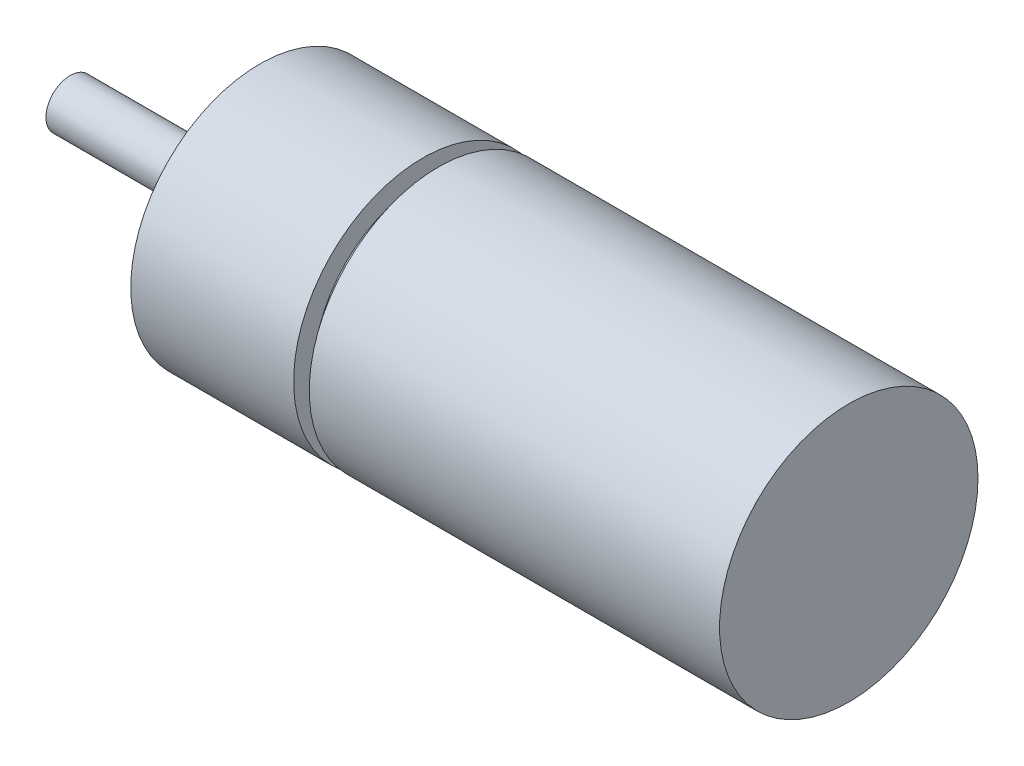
ISO-10303-21;
HEADER;
FILE_DESCRIPTION(('STEP AP214'),'2;1');
FILE_NAME('part.step','',(''),(''),'','','');
FILE_SCHEMA(('AUTOMOTIVE_DESIGN { 1 0 10303 214 1 1 1 1 }'));
ENDSEC;
DATA;
#1=APPLICATION_CONTEXT('core data for automotive mechanical design processes');
#2=APPLICATION_PROTOCOL_DEFINITION('international standard','automotive_design',2000,#1);
#3=PRODUCT_CONTEXT('',#1,'mechanical');
#4=PRODUCT('Part','Part','',(#3));
#5=PRODUCT_RELATED_PRODUCT_CATEGORY('part','',(#4));
#6=PRODUCT_DEFINITION_FORMATION('','',#4);
#7=PRODUCT_DEFINITION_CONTEXT('part definition',#1,'design');
#8=PRODUCT_DEFINITION('design','',#6,#7);
#9=PRODUCT_DEFINITION_SHAPE('','',#8);
#10=(LENGTH_UNIT() NAMED_UNIT(*) SI_UNIT(.MILLI.,.METRE.));
#11=(NAMED_UNIT(*) PLANE_ANGLE_UNIT() SI_UNIT($,.RADIAN.));
#12=(NAMED_UNIT(*) SI_UNIT($,.STERADIAN.) SOLID_ANGLE_UNIT());
#13=UNCERTAINTY_MEASURE_WITH_UNIT(LENGTH_MEASURE(1.E-05),#10,'distance_accuracy_value','');
#14=(GEOMETRIC_REPRESENTATION_CONTEXT(3) GLOBAL_UNCERTAINTY_ASSIGNED_CONTEXT((#13)) GLOBAL_UNIT_ASSIGNED_CONTEXT((#10,
#11,#12)) REPRESENTATION_CONTEXT('',''));
#15=CARTESIAN_POINT('',(0.,0.,0.));
#16=DIRECTION('',(0.,0.,1.));
#17=DIRECTION('',(1.,0.,0.));
#18=AXIS2_PLACEMENT_3D('',#15,#16,#17);
#19=CARTESIAN_POINT('',(-48.2,1.49999999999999,0.));
#20=DIRECTION('',(-1.,0.,0.));
#21=DIRECTION('',(0.,0.,1.));
#22=AXIS2_PLACEMENT_3D('',#19,#20,#21);
#23=PLANE('',#22);
#24=CARTESIAN_POINT('',(-48.2,0.,0.));
#25=DIRECTION('',(1.,0.,0.));
#26=DIRECTION('',(0.,0.,-1.));
#27=AXIS2_PLACEMENT_3D('',#24,#25,#26);
#28=CIRCLE('',#27,1.49999999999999);
#29=CARTESIAN_POINT('',(-48.2,0.,-1.49999999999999));
#30=VERTEX_POINT('',#29);
#31=EDGE_CURVE('E11',#30,#30,#28,.T.);
#32=ORIENTED_EDGE('',*,*,#31,.F.);
#33=EDGE_LOOP('',(#32));
#34=FACE_BOUND('',#33,.T.);
#35=ADVANCED_FACE('F31',(#34),#23,.T.);
#36=CARTESIAN_POINT('',(0.,0.,0.));
#37=DIRECTION('',(1.,0.,0.));
#38=DIRECTION('',(0.,0.,-1.));
#39=AXIS2_PLACEMENT_3D('',#36,#37,#38);
#40=CYLINDRICAL_SURFACE('',#39,1.49999999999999);
#41=ORIENTED_EDGE('',*,*,#31,.T.);
#42=EDGE_LOOP('',(#41));
#43=FACE_BOUND('',#42,.T.);
#44=CARTESIAN_POINT('',(-38.45,0.,0.));
#45=DIRECTION('',(1.,0.,0.));
#46=DIRECTION('',(0.,0.,-1.));
#47=AXIS2_PLACEMENT_3D('',#44,#45,#46);
#48=CIRCLE('',#47,1.5);
#49=CARTESIAN_POINT('',(-38.45,0.,-1.5));
#50=VERTEX_POINT('',#49);
#51=EDGE_CURVE('E38',#50,#50,#48,.T.);
#52=ORIENTED_EDGE('',*,*,#51,.F.);
#53=EDGE_LOOP('',(#52));
#54=FACE_BOUND('',#53,.T.);
#55=ADVANCED_FACE('F93',(#43,#54),#40,.T.);
#56=CARTESIAN_POINT('',(-38.45,3.,0.));
#57=DIRECTION('',(-1.,0.,0.));
#58=DIRECTION('',(0.,0.,1.));
#59=AXIS2_PLACEMENT_3D('',#56,#57,#58);
#60=PLANE('',#59);
#61=ORIENTED_EDGE('',*,*,#51,.T.);
#62=EDGE_LOOP('',(#61));
#63=FACE_BOUND('',#62,.T.);
#64=CARTESIAN_POINT('',(-38.45,0.,0.));
#65=DIRECTION('',(1.,0.,0.));
#66=DIRECTION('',(0.,0.,-1.));
#67=AXIS2_PLACEMENT_3D('',#64,#65,#66);
#68=CIRCLE('',#67,3.);
#69=CARTESIAN_POINT('',(-38.45,0.,-3.));
#70=VERTEX_POINT('',#69);
#71=EDGE_CURVE('E85',#70,#70,#68,.T.);
#72=ORIENTED_EDGE('',*,*,#71,.F.);
#73=EDGE_LOOP('',(#72));
#74=FACE_BOUND('',#73,.T.);
#75=ADVANCED_FACE('F90',(#63,#74),#60,.T.);
#76=CARTESIAN_POINT('',(0.,0.,0.));
#77=DIRECTION('',(1.,0.,0.));
#78=DIRECTION('',(0.,0.,-1.));
#79=AXIS2_PLACEMENT_3D('',#76,#77,#78);
#80=CYLINDRICAL_SURFACE('',#79,3.);
#81=ORIENTED_EDGE('',*,*,#71,.T.);
#82=EDGE_LOOP('',(#81));
#83=FACE_BOUND('',#82,.T.);
#84=CARTESIAN_POINT('',(-36.45,0.,0.));
#85=DIRECTION('',(1.,0.,0.));
#86=DIRECTION('',(0.,0.,-1.));
#87=AXIS2_PLACEMENT_3D('',#84,#85,#86);
#88=CIRCLE('',#87,3.);
#89=CARTESIAN_POINT('',(-36.45,0.,-3.));
#90=VERTEX_POINT('',#89);
#91=EDGE_CURVE('E82',#90,#90,#88,.T.);
#92=ORIENTED_EDGE('',*,*,#91,.F.);
#93=EDGE_LOOP('',(#92));
#94=FACE_BOUND('',#93,.T.);
#95=ADVANCED_FACE('F100',(#83,#94),#80,.T.);
#96=CARTESIAN_POINT('',(-36.45,7.99999999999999,0.));
#97=DIRECTION('',(-1.,0.,0.));
#98=DIRECTION('',(0.,0.,1.));
#99=AXIS2_PLACEMENT_3D('',#96,#97,#98);
#100=PLANE('',#99);
#101=CARTESIAN_POINT('',(-36.45,5.,0.));
#102=DIRECTION('',(-1.,0.,0.));
#103=DIRECTION('',(0.,0.,1.));
#104=AXIS2_PLACEMENT_3D('',#101,#102,#103);
#105=CIRCLE('',#104,0.799999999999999);
#106=CARTESIAN_POINT('',(-36.45,5.,0.799999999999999));
#107=VERTEX_POINT('',#106);
#108=EDGE_CURVE('E53',#107,#107,#105,.T.);
#109=ORIENTED_EDGE('',*,*,#108,.F.);
#110=EDGE_LOOP('',(#109));
#111=FACE_BOUND('',#110,.T.);
#112=CARTESIAN_POINT('',(-36.45,-5.,0.));
#113=DIRECTION('',(-1.,0.,0.));
#114=DIRECTION('',(0.,0.,1.));
#115=AXIS2_PLACEMENT_3D('',#112,#113,#114);
#116=CIRCLE('',#115,0.799999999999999);
#117=CARTESIAN_POINT('',(-36.45,-5.,0.8));
#118=VERTEX_POINT('',#117);
#119=EDGE_CURVE('E61',#118,#118,#116,.T.);
#120=ORIENTED_EDGE('',*,*,#119,.F.);
#121=EDGE_LOOP('',(#120));
#122=FACE_BOUND('',#121,.T.);
#123=ORIENTED_EDGE('',*,*,#91,.T.);
#124=EDGE_LOOP('',(#123));
#125=FACE_BOUND('',#124,.T.);
#126=CARTESIAN_POINT('',(-36.45,0.,0.));
#127=DIRECTION('',(1.,0.,0.));
#128=DIRECTION('',(0.,0.,-1.));
#129=AXIS2_PLACEMENT_3D('',#126,#127,#128);
#130=CIRCLE('',#129,7.99999999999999);
#131=CARTESIAN_POINT('',(-36.45,0.,-7.99999999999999));
#132=VERTEX_POINT('',#131);
#133=EDGE_CURVE('E79',#132,#132,#130,.T.);
#134=ORIENTED_EDGE('',*,*,#133,.F.);
#135=EDGE_LOOP('',(#134));
#136=FACE_BOUND('',#135,.T.);
#137=ADVANCED_FACE('F106',(#111,#122,#125,#136),#100,.T.);
#138=CARTESIAN_POINT('',(0.,0.,0.));
#139=DIRECTION('',(1.,0.,0.));
#140=DIRECTION('',(0.,0.,-1.));
#141=AXIS2_PLACEMENT_3D('',#138,#139,#140);
#142=CYLINDRICAL_SURFACE('',#141,7.99999999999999);
#143=ORIENTED_EDGE('',*,*,#133,.T.);
#144=EDGE_LOOP('',(#143));
#145=FACE_BOUND('',#144,.T.);
#146=CARTESIAN_POINT('',(-26.3674304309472,0.,0.));
#147=DIRECTION('',(1.,0.,0.));
#148=DIRECTION('',(0.,0.,-1.));
#149=AXIS2_PLACEMENT_3D('',#146,#147,#148);
#150=CIRCLE('',#149,7.99999999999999);
#151=CARTESIAN_POINT('',(-26.3674304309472,0.,-7.99999999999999));
#152=VERTEX_POINT('',#151);
#153=EDGE_CURVE('E76',#152,#152,#150,.T.);
#154=ORIENTED_EDGE('',*,*,#153,.F.);
#155=EDGE_LOOP('',(#154));
#156=FACE_BOUND('',#155,.T.);
#157=ADVANCED_FACE('F110',(#145,#156),#142,.T.);
#158=CARTESIAN_POINT('',(-26.3674304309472,6.74686295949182,0.));
#159=DIRECTION('',(1.,0.,0.));
#160=DIRECTION('',(0.,0.,-1.));
#161=AXIS2_PLACEMENT_3D('',#158,#159,#160);
#162=PLANE('',#161);
#163=ORIENTED_EDGE('',*,*,#153,.T.);
#164=EDGE_LOOP('',(#163));
#165=FACE_BOUND('',#164,.T.);
#166=CARTESIAN_POINT('',(-26.3674304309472,0.,0.));
#167=DIRECTION('',(1.,0.,0.));
#168=DIRECTION('',(0.,0.,-1.));
#169=AXIS2_PLACEMENT_3D('',#166,#167,#168);
#170=CIRCLE('',#169,6.74686295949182);
#171=CARTESIAN_POINT('',(-26.3674304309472,0.,-6.74686295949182));
#172=VERTEX_POINT('',#171);
#173=EDGE_CURVE('E73',#172,#172,#170,.T.);
#174=ORIENTED_EDGE('',*,*,#173,.F.);
#175=EDGE_LOOP('',(#174));
#176=FACE_BOUND('',#175,.T.);
#177=ADVANCED_FACE('F114',(#165,#176),#162,.T.);
#178=CARTESIAN_POINT('',(-25.4,0.,0.));
#179=DIRECTION('',(1.,0.,0.));
#180=DIRECTION('',(0.,0.,-1.));
#181=AXIS2_PLACEMENT_3D('',#178,#179,#180);
#182=CONICAL_SURFACE('',#181,6.99999999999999,0.255921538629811);
#183=ORIENTED_EDGE('',*,*,#173,.T.);
#184=EDGE_LOOP('',(#183));
#185=FACE_BOUND('',#184,.T.);
#186=CARTESIAN_POINT('',(-25.4,0.,0.));
#187=DIRECTION('',(1.,0.,0.));
#188=DIRECTION('',(0.,0.,-1.));
#189=AXIS2_PLACEMENT_3D('',#186,#187,#188);
#190=CIRCLE('',#189,6.99999999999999);
#191=CARTESIAN_POINT('',(-25.4,0.,-6.99999999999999));
#192=VERTEX_POINT('',#191);
#193=EDGE_CURVE('E70',#192,#192,#190,.T.);
#194=ORIENTED_EDGE('',*,*,#193,.F.);
#195=EDGE_LOOP('',(#194));
#196=FACE_BOUND('',#195,.T.);
#197=ADVANCED_FACE('F118',(#185,#196),#182,.T.);
#198=CARTESIAN_POINT('',(-25.4,7.99999999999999,0.));
#199=DIRECTION('',(-1.,0.,0.));
#200=DIRECTION('',(0.,0.,1.));
#201=AXIS2_PLACEMENT_3D('',#198,#199,#200);
#202=PLANE('',#201);
#203=ORIENTED_EDGE('',*,*,#193,.T.);
#204=EDGE_LOOP('',(#203));
#205=FACE_BOUND('',#204,.T.);
#206=CARTESIAN_POINT('',(-25.4,0.,0.));
#207=DIRECTION('',(1.,0.,0.));
#208=DIRECTION('',(0.,0.,-1.));
#209=AXIS2_PLACEMENT_3D('',#206,#207,#208);
#210=CIRCLE('',#209,7.99999999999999);
#211=CARTESIAN_POINT('',(-25.4,0.,-7.99999999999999));
#212=VERTEX_POINT('',#211);
#213=EDGE_CURVE('E67',#212,#212,#210,.T.);
#214=ORIENTED_EDGE('',*,*,#213,.F.);
#215=EDGE_LOOP('',(#214));
#216=FACE_BOUND('',#215,.T.);
#217=ADVANCED_FACE('F122',(#205,#216),#202,.T.);
#218=CARTESIAN_POINT('',(0.,0.,0.));
#219=DIRECTION('',(1.,0.,0.));
#220=DIRECTION('',(0.,0.,-1.));
#221=AXIS2_PLACEMENT_3D('',#218,#219,#220);
#222=CYLINDRICAL_SURFACE('',#221,8.);
#223=ORIENTED_EDGE('',*,*,#213,.T.);
#224=EDGE_LOOP('',(#223));
#225=FACE_BOUND('',#224,.T.);
#226=CARTESIAN_POINT('',(0.,0.,0.));
#227=DIRECTION('',(1.,0.,0.));
#228=DIRECTION('',(0.,0.,-1.));
#229=AXIS2_PLACEMENT_3D('',#226,#227,#228);
#230=CIRCLE('',#229,8.);
#231=CARTESIAN_POINT('',(0.,0.,-8.));
#232=VERTEX_POINT('',#231);
#233=EDGE_CURVE('E64',#232,#232,#230,.T.);
#234=ORIENTED_EDGE('',*,*,#233,.F.);
#235=EDGE_LOOP('',(#234));
#236=FACE_BOUND('',#235,.T.);
#237=ADVANCED_FACE('F126',(#225,#236),#222,.T.);
#238=CARTESIAN_POINT('',(0.,0.,0.));
#239=DIRECTION('',(1.,0.,0.));
#240=DIRECTION('',(0.,0.,-1.));
#241=AXIS2_PLACEMENT_3D('',#238,#239,#240);
#242=PLANE('',#241);
#243=ORIENTED_EDGE('',*,*,#233,.T.);
#244=EDGE_LOOP('',(#243));
#245=FACE_BOUND('',#244,.T.);
#246=ADVANCED_FACE('F130',(#245),#242,.T.);
#247=CARTESIAN_POINT('',(-36.45,-5.,0.));
#248=DIRECTION('',(-1.,0.,0.));
#249=DIRECTION('',(0.,0.,1.));
#250=AXIS2_PLACEMENT_3D('',#247,#248,#249);
#251=CYLINDRICAL_SURFACE('',#250,0.799999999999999);
#252=CARTESIAN_POINT('',(-31.116,-5.,0.));
#253=DIRECTION('',(-1.,0.,0.));
#254=DIRECTION('',(0.,0.,1.));
#255=AXIS2_PLACEMENT_3D('',#252,#253,#254);
#256=CIRCLE('',#255,0.799999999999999);
#257=CARTESIAN_POINT('',(-31.116,-5.,0.799999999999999));
#258=VERTEX_POINT('',#257);
#259=EDGE_CURVE('E56',#258,#258,#256,.T.);
#260=ORIENTED_EDGE('',*,*,#259,.F.);
#261=EDGE_LOOP('',(#260));
#262=FACE_BOUND('',#261,.T.);
#263=ORIENTED_EDGE('',*,*,#119,.T.);
#264=EDGE_LOOP('',(#263));
#265=FACE_BOUND('',#264,.T.);
#266=ADVANCED_FACE('F134',(#262,#265),#251,.F.);
#267=CARTESIAN_POINT('',(-31.116,-5.,0.));
#268=DIRECTION('',(-1.,0.,0.));
#269=DIRECTION('',(0.,0.,1.));
#270=AXIS2_PLACEMENT_3D('',#267,#268,#269);
#271=CONICAL_SURFACE('',#270,0.799999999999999,1.02974425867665);
#272=CARTESIAN_POINT('',(-30.6353115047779,-5.,0.));
#273=VERTEX_POINT('',#272);
#274=VERTEX_LOOP('',#273);
#275=FACE_BOUND('',#274,.T.);
#276=ORIENTED_EDGE('',*,*,#259,.T.);
#277=EDGE_LOOP('',(#276));
#278=FACE_BOUND('',#277,.T.);
#279=ADVANCED_FACE('F138',(#275,#278),#271,.F.);
#280=CARTESIAN_POINT('',(-36.45,5.,0.));
#281=DIRECTION('',(-1.,0.,0.));
#282=DIRECTION('',(0.,0.,1.));
#283=AXIS2_PLACEMENT_3D('',#280,#281,#282);
#284=CYLINDRICAL_SURFACE('',#283,0.799999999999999);
#285=CARTESIAN_POINT('',(-31.116,5.,0.));
#286=DIRECTION('',(-1.,0.,0.));
#287=DIRECTION('',(0.,0.,1.));
#288=AXIS2_PLACEMENT_3D('',#285,#286,#287);
#289=CIRCLE('',#288,0.799999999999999);
#290=CARTESIAN_POINT('',(-31.116,5.,0.799999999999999));
#291=VERTEX_POINT('',#290);
#292=EDGE_CURVE('E51',#291,#291,#289,.T.);
#293=ORIENTED_EDGE('',*,*,#292,.F.);
#294=EDGE_LOOP('',(#293));
#295=FACE_BOUND('',#294,.T.);
#296=ORIENTED_EDGE('',*,*,#108,.T.);
#297=EDGE_LOOP('',(#296));
#298=FACE_BOUND('',#297,.T.);
#299=ADVANCED_FACE('F47',(#295,#298),#284,.F.);
#300=CARTESIAN_POINT('',(-31.116,5.,0.));
#301=DIRECTION('',(-1.,0.,0.));
#302=DIRECTION('',(0.,0.,1.));
#303=AXIS2_PLACEMENT_3D('',#300,#301,#302);
#304=CONICAL_SURFACE('',#303,0.799999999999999,1.02974425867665);
#305=CARTESIAN_POINT('',(-30.6353115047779,5.,0.));
#306=VERTEX_POINT('',#305);
#307=VERTEX_LOOP('',#306);
#308=FACE_BOUND('',#307,.T.);
#309=ORIENTED_EDGE('',*,*,#292,.T.);
#310=EDGE_LOOP('',(#309));
#311=FACE_BOUND('',#310,.T.);
#312=ADVANCED_FACE('F44',(#308,#311),#304,.F.);
#313=CLOSED_SHELL('',(#35,#55,#75,#95,#137,#157,#177,#197,#217,#237,#246,#266,#279,#299,#312));
#314=MANIFOLD_SOLID_BREP('B2',#313);
#315=ADVANCED_BREP_SHAPE_REPRESENTATION('',(#18,#314),#14);
#316=SHAPE_DEFINITION_REPRESENTATION(#9,#315);
ENDSEC;
END-ISO-10303-21;
